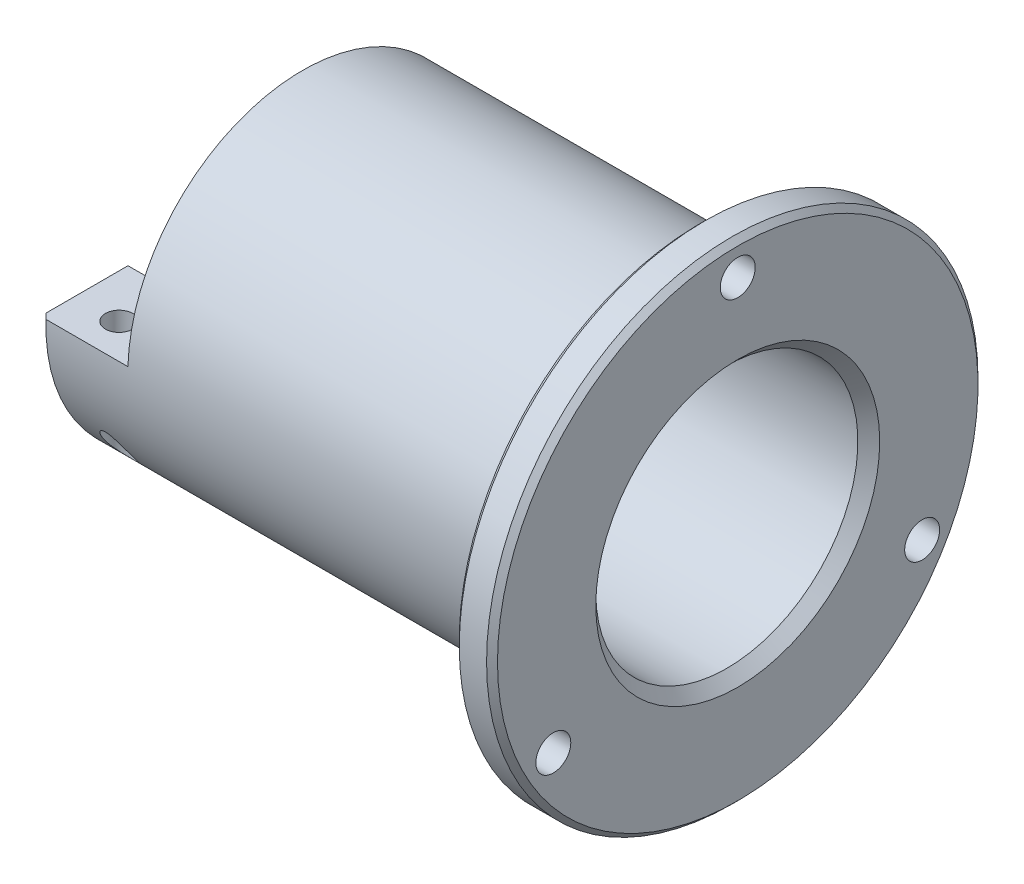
from build123d import *

# Parameters (mm, degrees)
ENL_V_MAT_EXTRU_1_DEPTH      = 8
PER_AGE3_D                   = 2.5
ESQUISSE10_R                 = 1.6
ENL_V_MAT_EXTRU_2_DEPTH      = 58.46409757
R_P_TITION_CIRCULAIRE1_COUNT = 3
CHANFREIN1_SIZE              = 1
CHANFREIN2_SIZE              = 0.5
CONG_1_R                     = 0.5


with BuildPart() as part:
    # Esquisse1 → Base-R_volution (revolve)
    with BuildSketch(Plane.XY, mode=Mode.PRIVATE) as base_r_volution_sk:
        Polygon((0, 8), (0, 16), (44.35, 16), (44.35, 22.5), (47.85, 22.5), (47.85, 12), (28.53, 12), (28.53, 10.5), (9.4, 10.5), (9.4, 8), align=None)
    revolve(base_r_volution_sk.sketch.rotate(Axis((0, 0, 0), (1, 0, 0)), 90), axis=Axis((0, 0, 0), (1, 0, 0)))

    # Esquisse2 → Enl_v. mat.-Extru.1 (cut)
    with BuildSketch(Plane.ZY):
        with BuildLine():
            Line((-15.992185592, 0.5), (-7.984359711, 0.5))
            ThreePointArc((-7.984359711, 0.5), (0, 8), (7.984359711, 0.5))
            Line((7.984359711, 0.5), (15.992185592, 0.5))
            ThreePointArc((15.992185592, 0.5), (0, 16), (-15.992185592, 0.5))
        make_face()
    extrude(amount=-ENL_V_MAT_EXTRU_1_DEPTH, mode=Mode.SUBTRACT)

    # Per_age3 (through all)
    with Locations(Plane(origin=(0, 0.5, 0), x_dir=(-1, 0, 0), z_dir=(0, 1, 0))):
        with Locations((-4, -12.8)):
            per_age3 = Hole(PER_AGE3_D / 2)

    # Sym_trie1: Per_age3 across plane
    add(per_age3.mirror(Plane.XY), mode=Mode.SUBTRACT)

    # Esquisse10 → Enl_v. mat.-Extru.2 (cut, through all)
    with BuildSketch(Plane(origin=(47.85, 0, 0), x_dir=(0, 0, -1), z_dir=(1, 0, 0))):
        with Locations((0, 19.5)):
            Circle(ESQUISSE10_R)
    enl_v_mat_extru_2 = extrude(amount=-ENL_V_MAT_EXTRU_2_DEPTH, mode=Mode.SUBTRACT)

    # R_p_tition circulaire1: Enl_v. mat.-Extru.2 ×3 about axis
    r_p_tition_circulaire1_axis = Axis((0, 0, 0), (1, 0, 0))
    for i in range(1, R_P_TITION_CIRCULAIRE1_COUNT):
        add(enl_v_mat_extru_2.rotate(r_p_tition_circulaire1_axis, i * 360 / R_P_TITION_CIRCULAIRE1_COUNT), mode=Mode.SUBTRACT)

    # Chanfrein1
    chanfrein1_edges = [part.edges().sort_by_distance(p)[0] for p in [
        (47.85, 0, -12),
    ]]
    chamfer(chanfrein1_edges, length=CHANFREIN1_SIZE)

    # Chanfrein2
    chanfrein2_edges = [part.edges().sort_by_distance(p)[0] for p in [
        (47.85, 0, -22.5),
        (44.35, 0, -22.5),
        (0, -15.998046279, -0.250030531),
        (0, 0.250030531, 15.998046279),
    ]]
    chamfer(chanfrein2_edges, length=CHANFREIN2_SIZE)

    # Cong_1
    cong_1_edges = [part.edges().sort_by_distance(p)[0] for p in [
        (44.35, 0, -16),
    ]]
    fillet(cong_1_edges, radius=CONG_1_R)


solid = part.part
